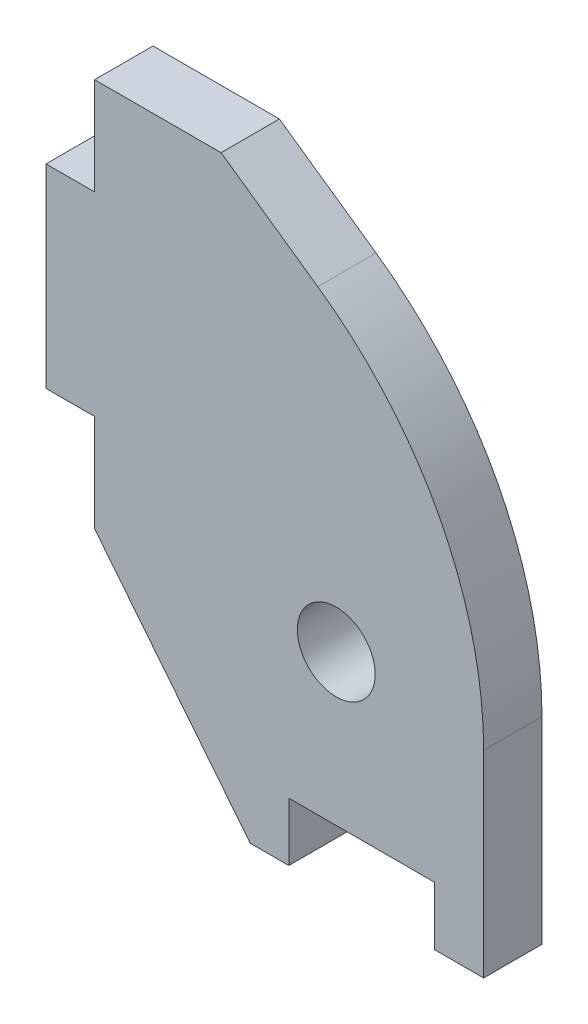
from build123d import *

# Parameters (mm, degrees)
BOSS_EXTRUDE1_DEPTH      = 3
F_4_0_4_DIAMETER_HOLE1_D = 4
SKETCH4_W                = 7.5
SKETCH4_H                = 3
CUT_EXTRUDE1_DEPTH       = 37.18010503
SKETCH5_W                = 3
SKETCH5_H                = 10
BOSS_EXTRUDE2_DEPTH      = 2.5


with BuildPart() as part:
    # Sketch1 → Boss-Extrude1 (new body)
    with BuildSketch(Plane.XY):
        with BuildLine():
            Line((0, 30), (6.5, 30))
            Line((6.5, 30), (11.471528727, 26.518898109))
            ThreePointArc((11.471528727, 26.518898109), (17.740216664, 19.370829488), (20, 10.135857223))
            Line((20, 10.135857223), (20, 0))
            Line((20, 0), (8, 0))
            Line((8, 0), (0, 10))
            Line((0, 10), (0, 30))
        make_face()
    extrude(amount=BOSS_EXTRUDE1_DEPTH)

    # 4.0 _4_ Diameter Hole1 (through all)
    with Locations(Plane.XY.offset(3)):
        with Locations((12.423290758, 10.728796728)):
            Hole(F_4_0_4_DIAMETER_HOLE1_D / 2)

    # Sketch4 → Cut-Extrude1 (cut, through all)
    with BuildSketch(Plane.XY.offset(3)):
        with Locations((13.731955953, 1.5)):
            Rectangle(SKETCH4_W, SKETCH4_H)
    extrude(amount=-CUT_EXTRUDE1_DEPTH, mode=Mode.SUBTRACT)

    # Sketch5 → Boss-Extrude2 (add)
    with BuildSketch(Plane.ZY):
        with Locations((1.5, 20)):
            Rectangle(SKETCH5_W, SKETCH5_H)
    extrude(amount=BOSS_EXTRUDE2_DEPTH)


solid = part.part
